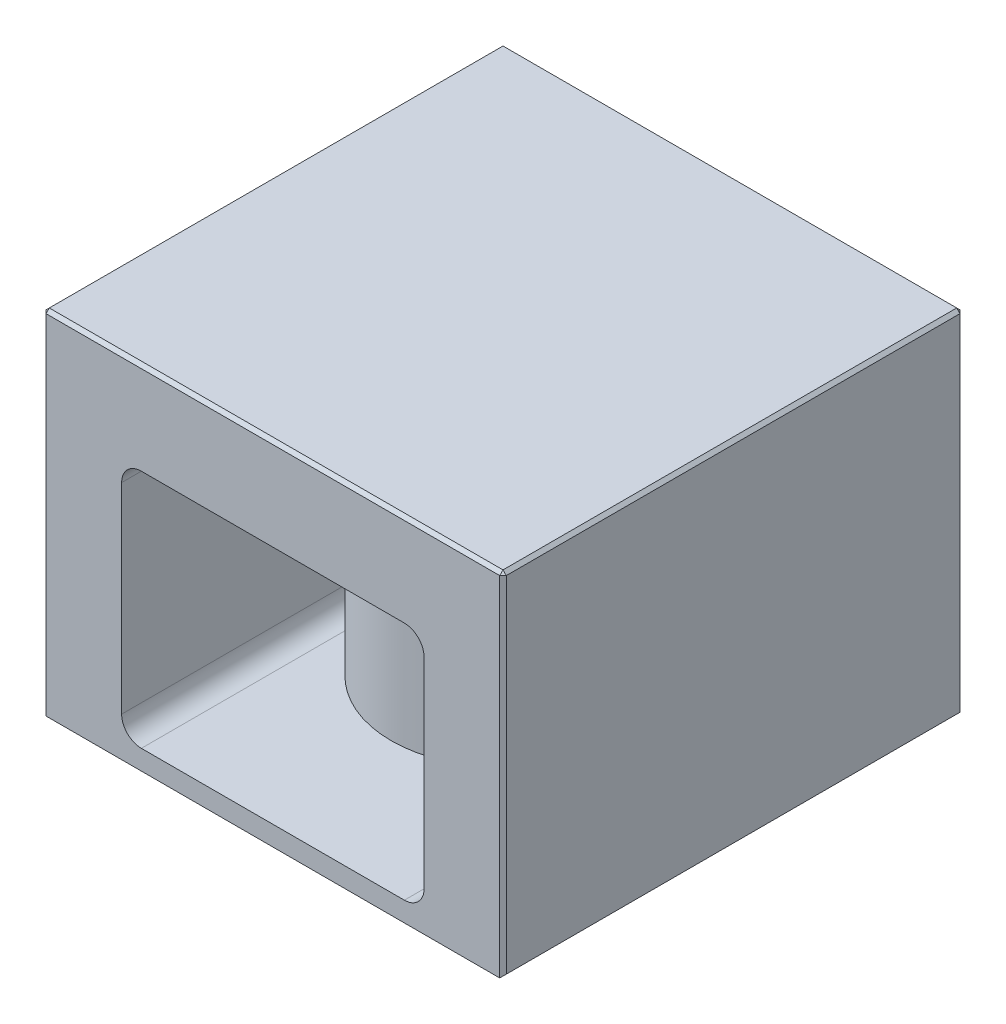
from build123d import *

# Parameters (mm, degrees)
SKETCH_1_W          = 70
SKETCH_1_H          = 70
EXTRUDE_1_DEPTH     = 53.5
CUT_EXTRUDE_1_DEPTH = 70
CHAMFER_1_SIZE      = 0.5
EXTRUDE_START       = 1.5
SKETCH_3_R          = 17
EXTRUDE_2_DEPTH     = 33


with BuildPart() as part:
    # Sketch 1 → Extrude 1 (new body)
    with BuildSketch(Plane(origin=(0, 0, 0), x_dir=(1, 0, 0), z_dir=(0, 1, 0))):
        Rectangle(SKETCH_1_W, SKETCH_1_H)
    extrude(amount=-EXTRUDE_1_DEPTH)

    # Sketch 2 → Cut-Extrude 1 (cut)
    with BuildSketch(Plane.XY.offset(35)):
        with BuildLine():
            Line((-20, -50.5), (20, -50.5))
            ThreePointArc((20, -50.5), (22.121320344, -49.621320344), (23, -47.5))
            Line((23, -47.5), (23, -17))
            ThreePointArc((23, -17), (22.121320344, -14.878679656), (20, -14))
            Line((20, -14), (-20, -14))
            ThreePointArc((-20, -14), (-22.121320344, -14.878679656), (-23, -17))
            Line((-23, -17), (-23, -47.5))
            ThreePointArc((-23, -47.5), (-22.121320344, -49.621320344), (-20, -50.5))
        make_face()
    extrude(amount=-CUT_EXTRUDE_1_DEPTH, mode=Mode.SUBTRACT)

    # Chamfer 1
    chamfer_1_edges = [part.edges().sort_by_distance(p)[0] for p in [
        (-35, -53.5, 0),
        (35, -53.5, 0),
        (0, 0, 35),
        (-35, 0, 0),
        (0, 0, -35),
        (35, 0, 0),
        (35, -26.75, 35),
        (-35, -26.75, 35),
        (-35, -26.75, -35),
        (35, -26.75, -35),
    ]]
    chamfer(chamfer_1_edges, length=CHAMFER_1_SIZE)


with BuildPart() as body_2:
    # Sketch 3 → Extrude 2 (new body)
    with BuildSketch(Plane.XZ.offset(14).offset(EXTRUDE_START)):
        with Locations(Location((0, 0, 0), (0, 0, 270))):
            Circle(SKETCH_3_R)
    extrude(amount=EXTRUDE_2_DEPTH)


solid = Compound([part.part, body_2.part])
